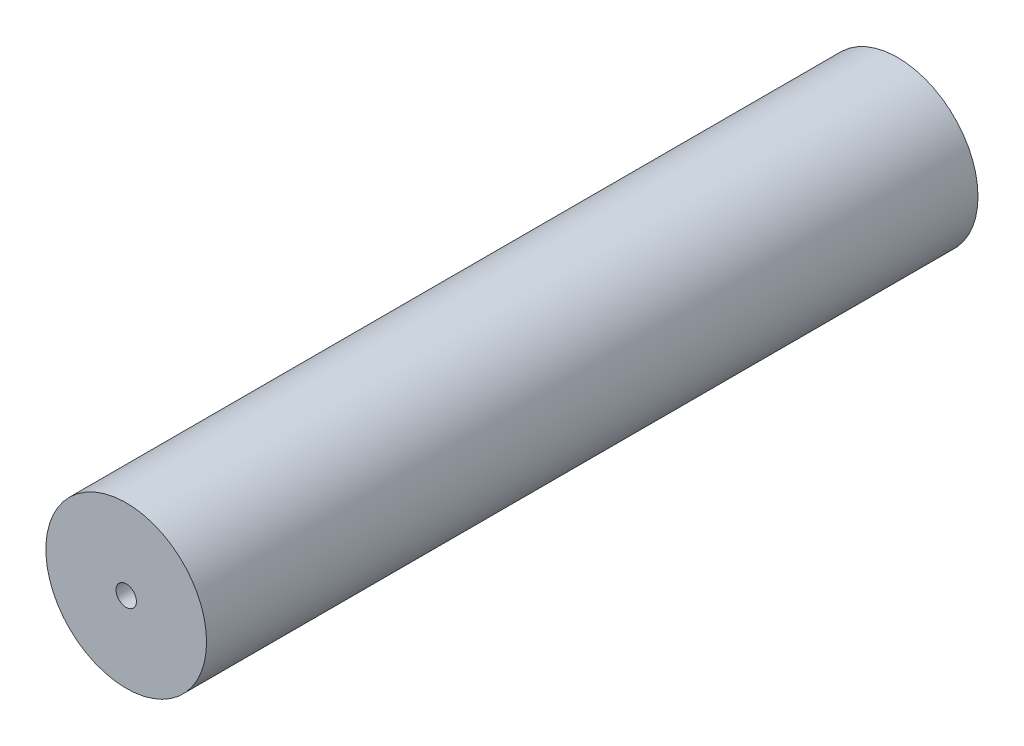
ISO-10303-21;
HEADER;
FILE_DESCRIPTION(('STEP AP214'),'2;1');
FILE_NAME('part.step','',(''),(''),'','','');
FILE_SCHEMA(('AUTOMOTIVE_DESIGN { 1 0 10303 214 1 1 1 1 }'));
ENDSEC;
DATA;
#1=APPLICATION_CONTEXT('core data for automotive mechanical design processes');
#2=APPLICATION_PROTOCOL_DEFINITION('international standard','automotive_design',2000,#1);
#3=PRODUCT_CONTEXT('',#1,'mechanical');
#4=PRODUCT('Part','Part','',(#3));
#5=PRODUCT_RELATED_PRODUCT_CATEGORY('part','',(#4));
#6=PRODUCT_DEFINITION_FORMATION('','',#4);
#7=PRODUCT_DEFINITION_CONTEXT('part definition',#1,'design');
#8=PRODUCT_DEFINITION('design','',#6,#7);
#9=PRODUCT_DEFINITION_SHAPE('','',#8);
#10=(LENGTH_UNIT() NAMED_UNIT(*) SI_UNIT(.MILLI.,.METRE.));
#11=(NAMED_UNIT(*) PLANE_ANGLE_UNIT() SI_UNIT($,.RADIAN.));
#12=(NAMED_UNIT(*) SI_UNIT($,.STERADIAN.) SOLID_ANGLE_UNIT());
#13=UNCERTAINTY_MEASURE_WITH_UNIT(LENGTH_MEASURE(1.E-05),#10,'distance_accuracy_value','');
#14=(GEOMETRIC_REPRESENTATION_CONTEXT(3) GLOBAL_UNCERTAINTY_ASSIGNED_CONTEXT((#13)) GLOBAL_UNIT_ASSIGNED_CONTEXT((#10,
#11,#12)) REPRESENTATION_CONTEXT('',''));
#15=CARTESIAN_POINT('',(0.,0.,0.));
#16=DIRECTION('',(0.,0.,1.));
#17=DIRECTION('',(1.,0.,0.));
#18=AXIS2_PLACEMENT_3D('',#15,#16,#17);
#19=CARTESIAN_POINT('',(15.5750000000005,20.9124999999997,-120.));
#20=DIRECTION('',(0.,0.,1.));
#21=DIRECTION('',(1.,0.,0.));
#22=AXIS2_PLACEMENT_3D('',#19,#20,#21);
#23=CYLINDRICAL_SURFACE('',#22,1.58749999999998);
#24=CARTESIAN_POINT('',(15.5750000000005,20.9124999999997,-120.));
#25=DIRECTION('',(0.,0.,1.));
#26=DIRECTION('',(1.,0.,0.));
#27=AXIS2_PLACEMENT_3D('',#24,#25,#26);
#28=CIRCLE('',#27,1.58749999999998);
#29=CARTESIAN_POINT('',(17.1625000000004,20.9124999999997,-120.));
#30=VERTEX_POINT('',#29);
#31=EDGE_CURVE('E44',#30,#30,#28,.T.);
#32=ORIENTED_EDGE('',*,*,#31,.F.);
#33=EDGE_LOOP('',(#32));
#34=FACE_BOUND('',#33,.T.);
#35=CARTESIAN_POINT('',(15.5750000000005,20.9124999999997,0.));
#36=DIRECTION('',(0.,0.,1.));
#37=DIRECTION('',(1.,0.,0.));
#38=AXIS2_PLACEMENT_3D('',#35,#36,#37);
#39=CIRCLE('',#38,1.58749999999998);
#40=CARTESIAN_POINT('',(17.1625000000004,20.9124999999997,0.));
#41=VERTEX_POINT('',#40);
#42=EDGE_CURVE('E50',#41,#41,#39,.T.);
#43=ORIENTED_EDGE('',*,*,#42,.T.);
#44=EDGE_LOOP('',(#43));
#45=FACE_BOUND('',#44,.T.);
#46=ADVANCED_FACE('F37',(#34,#45),#23,.F.);
#47=CARTESIAN_POINT('',(15.5750000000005,20.9124999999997,-120.));
#48=DIRECTION('',(0.,0.,1.));
#49=DIRECTION('',(1.,0.,0.));
#50=AXIS2_PLACEMENT_3D('',#47,#48,#49);
#51=CYLINDRICAL_SURFACE('',#50,12.5);
#52=CARTESIAN_POINT('',(15.5750000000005,20.9124999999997,-120.));
#53=DIRECTION('',(0.,0.,1.));
#54=DIRECTION('',(1.,0.,0.));
#55=AXIS2_PLACEMENT_3D('',#52,#53,#54);
#56=CIRCLE('',#55,12.5);
#57=CARTESIAN_POINT('',(28.0750000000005,20.9124999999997,-120.));
#58=VERTEX_POINT('',#57);
#59=EDGE_CURVE('E10',#58,#58,#56,.T.);
#60=ORIENTED_EDGE('',*,*,#59,.T.);
#61=EDGE_LOOP('',(#60));
#62=FACE_BOUND('',#61,.T.);
#63=CARTESIAN_POINT('',(15.5750000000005,20.9124999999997,0.));
#64=DIRECTION('',(0.,0.,1.));
#65=DIRECTION('',(1.,0.,0.));
#66=AXIS2_PLACEMENT_3D('',#63,#64,#65);
#67=CIRCLE('',#66,12.5);
#68=CARTESIAN_POINT('',(28.0750000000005,20.9124999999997,0.));
#69=VERTEX_POINT('',#68);
#70=EDGE_CURVE('E40',#69,#69,#67,.T.);
#71=ORIENTED_EDGE('',*,*,#70,.F.);
#72=EDGE_LOOP('',(#71));
#73=FACE_BOUND('',#72,.T.);
#74=ADVANCED_FACE('F59',(#62,#73),#51,.T.);
#75=CARTESIAN_POINT('',(0.,0.,-120.));
#76=DIRECTION('',(0.,0.,1.));
#77=DIRECTION('',(1.,0.,0.));
#78=AXIS2_PLACEMENT_3D('',#75,#76,#77);
#79=PLANE('',#78);
#80=ORIENTED_EDGE('',*,*,#31,.T.);
#81=EDGE_LOOP('',(#80));
#82=FACE_BOUND('',#81,.T.);
#83=ORIENTED_EDGE('',*,*,#59,.F.);
#84=EDGE_LOOP('',(#83));
#85=FACE_BOUND('',#84,.T.);
#86=ADVANCED_FACE('F61',(#82,#85),#79,.F.);
#87=CARTESIAN_POINT('',(0.,0.,0.));
#88=DIRECTION('',(0.,0.,1.));
#89=DIRECTION('',(1.,0.,0.));
#90=AXIS2_PLACEMENT_3D('',#87,#88,#89);
#91=PLANE('',#90);
#92=ORIENTED_EDGE('',*,*,#42,.F.);
#93=EDGE_LOOP('',(#92));
#94=FACE_BOUND('',#93,.T.);
#95=ORIENTED_EDGE('',*,*,#70,.T.);
#96=EDGE_LOOP('',(#95));
#97=FACE_BOUND('',#96,.T.);
#98=ADVANCED_FACE('F57',(#94,#97),#91,.T.);
#99=CLOSED_SHELL('',(#46,#74,#86,#98));
#100=MANIFOLD_SOLID_BREP('B2',#99);
#101=ADVANCED_BREP_SHAPE_REPRESENTATION('',(#18,#100),#14);
#102=SHAPE_DEFINITION_REPRESENTATION(#9,#101);
ENDSEC;
END-ISO-10303-21;
